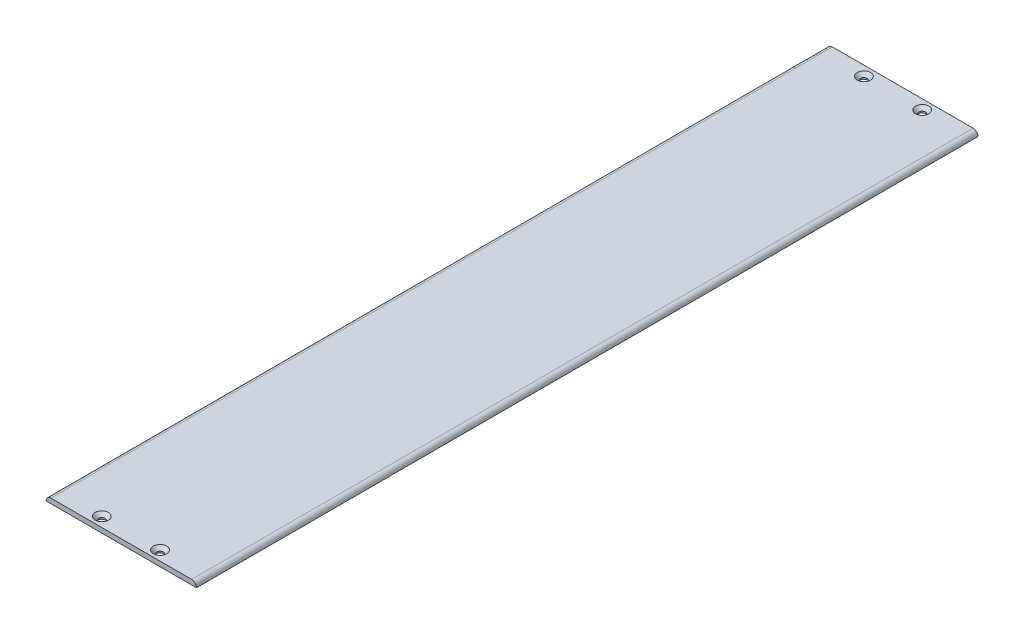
ISO-10303-21;
HEADER;
FILE_DESCRIPTION(('STEP AP214'),'2;1');
FILE_NAME('part.step','',(''),(''),'','','');
FILE_SCHEMA(('AUTOMOTIVE_DESIGN { 1 0 10303 214 1 1 1 1 }'));
ENDSEC;
DATA;
#1=APPLICATION_CONTEXT('core data for automotive mechanical design processes');
#2=APPLICATION_PROTOCOL_DEFINITION('international standard','automotive_design',2000,#1);
#3=PRODUCT_CONTEXT('',#1,'mechanical');
#4=PRODUCT('Part','Part','',(#3));
#5=PRODUCT_RELATED_PRODUCT_CATEGORY('part','',(#4));
#6=PRODUCT_DEFINITION_FORMATION('','',#4);
#7=PRODUCT_DEFINITION_CONTEXT('part definition',#1,'design');
#8=PRODUCT_DEFINITION('design','',#6,#7);
#9=PRODUCT_DEFINITION_SHAPE('','',#8);
#10=(LENGTH_UNIT() NAMED_UNIT(*) SI_UNIT(.MILLI.,.METRE.));
#11=(NAMED_UNIT(*) PLANE_ANGLE_UNIT() SI_UNIT($,.RADIAN.));
#12=(NAMED_UNIT(*) SI_UNIT($,.STERADIAN.) SOLID_ANGLE_UNIT());
#13=UNCERTAINTY_MEASURE_WITH_UNIT(LENGTH_MEASURE(1.E-05),#10,'distance_accuracy_value','');
#14=(GEOMETRIC_REPRESENTATION_CONTEXT(3) GLOBAL_UNCERTAINTY_ASSIGNED_CONTEXT((#13)) GLOBAL_UNIT_ASSIGNED_CONTEXT((#10,
#11,#12)) REPRESENTATION_CONTEXT('',''));
#15=CARTESIAN_POINT('',(0.,0.,0.));
#16=DIRECTION('',(0.,0.,1.));
#17=DIRECTION('',(1.,0.,0.));
#18=AXIS2_PLACEMENT_3D('',#15,#16,#17);
#19=CARTESIAN_POINT('',(-31.,0.,161.));
#20=DIRECTION('',(0.,1.,0.));
#21=DIRECTION('',(0.,0.,1.));
#22=AXIS2_PLACEMENT_3D('',#19,#20,#21);
#23=PLANE('',#22);
#24=CARTESIAN_POINT('',(-12.,0.,157.));
#25=DIRECTION('',(0.,1.,0.));
#26=DIRECTION('',(0.,0.,1.));
#27=AXIS2_PLACEMENT_3D('',#24,#25,#26);
#28=CIRCLE('',#27,1.35);
#29=CARTESIAN_POINT('',(-12.,0.,158.35));
#30=VERTEX_POINT('',#29);
#31=EDGE_CURVE('E141',#30,#30,#28,.T.);
#32=ORIENTED_EDGE('',*,*,#31,.T.);
#33=EDGE_LOOP('',(#32));
#34=FACE_BOUND('',#33,.T.);
#35=CARTESIAN_POINT('',(12.,0.,157.));
#36=DIRECTION('',(0.,1.,0.));
#37=DIRECTION('',(0.,0.,1.));
#38=AXIS2_PLACEMENT_3D('',#35,#36,#37);
#39=CIRCLE('',#38,1.35);
#40=CARTESIAN_POINT('',(12.,0.,158.35));
#41=VERTEX_POINT('',#40);
#42=EDGE_CURVE('E132',#41,#41,#39,.T.);
#43=ORIENTED_EDGE('',*,*,#42,.T.);
#44=EDGE_LOOP('',(#43));
#45=FACE_BOUND('',#44,.T.);
#46=CARTESIAN_POINT('',(12.,0.,-157.));
#47=DIRECTION('',(0.,1.,0.));
#48=DIRECTION('',(0.,0.,1.));
#49=AXIS2_PLACEMENT_3D('',#46,#47,#48);
#50=CIRCLE('',#49,1.35);
#51=CARTESIAN_POINT('',(12.,0.,-155.65));
#52=VERTEX_POINT('',#51);
#53=EDGE_CURVE('E123',#52,#52,#50,.T.);
#54=ORIENTED_EDGE('',*,*,#53,.T.);
#55=EDGE_LOOP('',(#54));
#56=FACE_BOUND('',#55,.T.);
#57=CARTESIAN_POINT('',(-12.,0.,-157.));
#58=DIRECTION('',(0.,1.,0.));
#59=DIRECTION('',(0.,0.,1.));
#60=AXIS2_PLACEMENT_3D('',#57,#58,#59);
#61=CIRCLE('',#60,1.35);
#62=CARTESIAN_POINT('',(-12.,0.,-155.65));
#63=VERTEX_POINT('',#62);
#64=EDGE_CURVE('E109',#63,#63,#61,.T.);
#65=ORIENTED_EDGE('',*,*,#64,.T.);
#66=EDGE_LOOP('',(#65));
#67=FACE_BOUND('',#66,.T.);
#68=DIRECTION('',(1.,0.,0.));
#69=VECTOR('',#68,1.);
#70=CARTESIAN_POINT('',(-31.,0.,-161.));
#71=LINE('',#70,#69);
#72=CARTESIAN_POINT('',(-31.,0.,-161.));
#73=VERTEX_POINT('',#72);
#74=CARTESIAN_POINT('',(31.,0.,-161.));
#75=VERTEX_POINT('',#74);
#76=EDGE_CURVE('E106',#73,#75,#71,.T.);
#77=ORIENTED_EDGE('',*,*,#76,.T.);
#78=DIRECTION('',(0.,0.,-1.));
#79=VECTOR('',#78,1.);
#80=CARTESIAN_POINT('',(31.,0.,161.));
#81=LINE('',#80,#79);
#82=CARTESIAN_POINT('',(31.,0.,161.));
#83=VERTEX_POINT('',#82);
#84=EDGE_CURVE('E89',#83,#75,#81,.T.);
#85=ORIENTED_EDGE('',*,*,#84,.F.);
#86=DIRECTION('',(1.,0.,0.));
#87=VECTOR('',#86,1.);
#88=CARTESIAN_POINT('',(-31.,0.,161.));
#89=LINE('',#88,#87);
#90=CARTESIAN_POINT('',(-31.,0.,161.));
#91=VERTEX_POINT('',#90);
#92=EDGE_CURVE('E78',#91,#83,#89,.T.);
#93=ORIENTED_EDGE('',*,*,#92,.F.);
#94=DIRECTION('',(0.,0.,-1.));
#95=VECTOR('',#94,1.);
#96=CARTESIAN_POINT('',(-31.,0.,161.));
#97=LINE('',#96,#95);
#98=EDGE_CURVE('E87',#91,#73,#97,.T.);
#99=ORIENTED_EDGE('',*,*,#98,.T.);
#100=EDGE_LOOP('',(#77,#85,#93,#99));
#101=FACE_BOUND('',#100,.T.);
#102=ADVANCED_FACE('F38',(#34,#45,#56,#67,#101),#23,.F.);
#103=CARTESIAN_POINT('',(-31.,2.,161.));
#104=DIRECTION('',(0.,-1.,0.));
#105=DIRECTION('',(0.,0.,-1.));
#106=AXIS2_PLACEMENT_3D('',#103,#104,#105);
#107=PLANE('',#106);
#108=CARTESIAN_POINT('',(-12.,2.,157.));
#109=DIRECTION('',(0.,1.,0.));
#110=DIRECTION('',(0.,0.,1.));
#111=AXIS2_PLACEMENT_3D('',#108,#109,#110);
#112=CIRCLE('',#111,2.75);
#113=CARTESIAN_POINT('',(-12.,2.,159.75));
#114=VERTEX_POINT('',#113);
#115=EDGE_CURVE('E147',#114,#114,#112,.T.);
#116=ORIENTED_EDGE('',*,*,#115,.F.);
#117=EDGE_LOOP('',(#116));
#118=FACE_BOUND('',#117,.T.);
#119=CARTESIAN_POINT('',(12.,2.,157.));
#120=DIRECTION('',(0.,1.,0.));
#121=DIRECTION('',(0.,0.,1.));
#122=AXIS2_PLACEMENT_3D('',#119,#120,#121);
#123=CIRCLE('',#122,2.75);
#124=CARTESIAN_POINT('',(12.,2.,159.75));
#125=VERTEX_POINT('',#124);
#126=EDGE_CURVE('E138',#125,#125,#123,.T.);
#127=ORIENTED_EDGE('',*,*,#126,.F.);
#128=EDGE_LOOP('',(#127));
#129=FACE_BOUND('',#128,.T.);
#130=CARTESIAN_POINT('',(12.,2.,-157.));
#131=DIRECTION('',(0.,1.,0.));
#132=DIRECTION('',(0.,0.,1.));
#133=AXIS2_PLACEMENT_3D('',#130,#131,#132);
#134=CIRCLE('',#133,2.75);
#135=CARTESIAN_POINT('',(12.,2.,-154.25));
#136=VERTEX_POINT('',#135);
#137=EDGE_CURVE('E129',#136,#136,#134,.T.);
#138=ORIENTED_EDGE('',*,*,#137,.F.);
#139=EDGE_LOOP('',(#138));
#140=FACE_BOUND('',#139,.T.);
#141=CARTESIAN_POINT('',(-12.,2.,-157.));
#142=DIRECTION('',(0.,1.,0.));
#143=DIRECTION('',(0.,0.,1.));
#144=AXIS2_PLACEMENT_3D('',#141,#142,#143);
#145=CIRCLE('',#144,2.75);
#146=CARTESIAN_POINT('',(-12.,2.,-154.25));
#147=VERTEX_POINT('',#146);
#148=EDGE_CURVE('E120',#147,#147,#145,.T.);
#149=ORIENTED_EDGE('',*,*,#148,.F.);
#150=EDGE_LOOP('',(#149));
#151=FACE_BOUND('',#150,.T.);
#152=DIRECTION('',(-1.,0.,0.));
#153=VECTOR('',#152,1.);
#154=CARTESIAN_POINT('',(-31.,2.,161.));
#155=LINE('',#154,#153);
#156=CARTESIAN_POINT('',(29.,2.,161.));
#157=VERTEX_POINT('',#156);
#158=CARTESIAN_POINT('',(-29.,2.,161.));
#159=VERTEX_POINT('',#158);
#160=EDGE_CURVE('E80',#157,#159,#155,.T.);
#161=ORIENTED_EDGE('',*,*,#160,.F.);
#162=DIRECTION('',(0.,0.,-1.));
#163=VECTOR('',#162,1.);
#164=CARTESIAN_POINT('',(29.,2.,161.));
#165=LINE('',#164,#163);
#166=CARTESIAN_POINT('',(29.,2.,-161.));
#167=VERTEX_POINT('',#166);
#168=EDGE_CURVE('E95',#157,#167,#165,.T.);
#169=ORIENTED_EDGE('',*,*,#168,.T.);
#170=DIRECTION('',(-1.,0.,0.));
#171=VECTOR('',#170,1.);
#172=CARTESIAN_POINT('',(-31.,2.,-161.));
#173=LINE('',#172,#171);
#174=CARTESIAN_POINT('',(-29.,2.,-161.));
#175=VERTEX_POINT('',#174);
#176=EDGE_CURVE('E90',#167,#175,#173,.T.);
#177=ORIENTED_EDGE('',*,*,#176,.T.);
#178=DIRECTION('',(0.,0.,-1.));
#179=VECTOR('',#178,1.);
#180=CARTESIAN_POINT('',(-29.,2.,161.));
#181=LINE('',#180,#179);
#182=EDGE_CURVE('E53',#175,#159,#181,.F.);
#183=ORIENTED_EDGE('',*,*,#182,.T.);
#184=EDGE_LOOP('',(#161,#169,#177,#183));
#185=FACE_BOUND('',#184,.T.);
#186=ADVANCED_FACE('F112',(#118,#129,#140,#151,#185),#107,.F.);
#187=CARTESIAN_POINT('',(-31.,0.,161.));
#188=DIRECTION('',(0.,0.,1.));
#189=DIRECTION('',(1.,0.,0.));
#190=AXIS2_PLACEMENT_3D('',#187,#188,#189);
#191=PLANE('',#190);
#192=ORIENTED_EDGE('',*,*,#92,.T.);
#193=CARTESIAN_POINT('',(29.,0.,161.));
#194=DIRECTION('',(0.,0.,1.));
#195=DIRECTION('',(1.,0.,0.));
#196=AXIS2_PLACEMENT_3D('',#193,#194,#195);
#197=CIRCLE('',#196,2.);
#198=EDGE_CURVE('E11',#83,#157,#197,.T.);
#199=ORIENTED_EDGE('',*,*,#198,.T.);
#200=ORIENTED_EDGE('',*,*,#160,.T.);
#201=CARTESIAN_POINT('',(-29.,0.,161.));
#202=DIRECTION('',(0.,0.,1.));
#203=DIRECTION('',(1.,0.,0.));
#204=AXIS2_PLACEMENT_3D('',#201,#202,#203);
#205=CIRCLE('',#204,2.);
#206=EDGE_CURVE('E46',#159,#91,#205,.T.);
#207=ORIENTED_EDGE('',*,*,#206,.T.);
#208=EDGE_LOOP('',(#192,#199,#200,#207));
#209=FACE_BOUND('',#208,.T.);
#210=ADVANCED_FACE('F77',(#209),#191,.T.);
#211=CARTESIAN_POINT('',(-31.,0.,-161.));
#212=DIRECTION('',(0.,0.,1.));
#213=DIRECTION('',(1.,0.,0.));
#214=AXIS2_PLACEMENT_3D('',#211,#212,#213);
#215=PLANE('',#214);
#216=ORIENTED_EDGE('',*,*,#176,.F.);
#217=CARTESIAN_POINT('',(29.,0.,-161.));
#218=DIRECTION('',(0.,0.,1.));
#219=DIRECTION('',(1.,0.,0.));
#220=AXIS2_PLACEMENT_3D('',#217,#218,#219);
#221=CIRCLE('',#220,2.);
#222=EDGE_CURVE('E83',#167,#75,#221,.F.);
#223=ORIENTED_EDGE('',*,*,#222,.T.);
#224=ORIENTED_EDGE('',*,*,#76,.F.);
#225=CARTESIAN_POINT('',(-29.,0.,-161.));
#226=DIRECTION('',(0.,0.,1.));
#227=DIRECTION('',(1.,0.,0.));
#228=AXIS2_PLACEMENT_3D('',#225,#226,#227);
#229=CIRCLE('',#228,2.);
#230=EDGE_CURVE('E92',#73,#175,#229,.F.);
#231=ORIENTED_EDGE('',*,*,#230,.T.);
#232=EDGE_LOOP('',(#216,#223,#224,#231));
#233=FACE_BOUND('',#232,.T.);
#234=ADVANCED_FACE('F105',(#233),#215,.F.);
#235=CARTESIAN_POINT('',(29.,0.,161.));
#236=DIRECTION('',(0.,0.,-1.));
#237=DIRECTION('',(-1.,0.,0.));
#238=AXIS2_PLACEMENT_3D('',#235,#236,#237);
#239=CYLINDRICAL_SURFACE('',#238,2.);
#240=ORIENTED_EDGE('',*,*,#198,.F.);
#241=ORIENTED_EDGE('',*,*,#84,.T.);
#242=ORIENTED_EDGE('',*,*,#222,.F.);
#243=ORIENTED_EDGE('',*,*,#168,.F.);
#244=EDGE_LOOP('',(#240,#241,#242,#243));
#245=FACE_BOUND('',#244,.T.);
#246=ADVANCED_FACE('F111',(#245),#239,.T.);
#247=CARTESIAN_POINT('',(-29.,0.,161.));
#248=DIRECTION('',(0.,0.,-1.));
#249=DIRECTION('',(-1.,0.,0.));
#250=AXIS2_PLACEMENT_3D('',#247,#248,#249);
#251=CYLINDRICAL_SURFACE('',#250,2.);
#252=ORIENTED_EDGE('',*,*,#206,.F.);
#253=ORIENTED_EDGE('',*,*,#182,.F.);
#254=ORIENTED_EDGE('',*,*,#230,.F.);
#255=ORIENTED_EDGE('',*,*,#98,.F.);
#256=EDGE_LOOP('',(#252,#253,#254,#255));
#257=FACE_BOUND('',#256,.T.);
#258=ADVANCED_FACE('F40',(#257),#251,.T.);
#259=CARTESIAN_POINT('',(-12.,2.,-157.));
#260=DIRECTION('',(0.,1.,0.));
#261=DIRECTION('',(0.,0.,1.));
#262=AXIS2_PLACEMENT_3D('',#259,#260,#261);
#263=CYLINDRICAL_SURFACE('',#262,1.34999999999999);
#264=ORIENTED_EDGE('',*,*,#64,.F.);
#265=EDGE_LOOP('',(#264));
#266=FACE_BOUND('',#265,.T.);
#267=CARTESIAN_POINT('',(-12.,0.599999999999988,-157.));
#268=DIRECTION('',(0.,1.,0.));
#269=DIRECTION('',(0.,0.,1.));
#270=AXIS2_PLACEMENT_3D('',#267,#268,#269);
#271=CIRCLE('',#270,1.34999999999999);
#272=CARTESIAN_POINT('',(-12.,0.599999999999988,-155.65));
#273=VERTEX_POINT('',#272);
#274=EDGE_CURVE('E117',#273,#273,#271,.T.);
#275=ORIENTED_EDGE('',*,*,#274,.T.);
#276=EDGE_LOOP('',(#275));
#277=FACE_BOUND('',#276,.T.);
#278=ADVANCED_FACE('F165',(#266,#277),#263,.F.);
#279=CARTESIAN_POINT('',(-12.,2.,-157.));
#280=DIRECTION('',(0.,1.,0.));
#281=DIRECTION('',(0.,0.,1.));
#282=AXIS2_PLACEMENT_3D('',#279,#280,#281);
#283=CONICAL_SURFACE('',#282,2.75,0.785398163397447);
#284=ORIENTED_EDGE('',*,*,#274,.F.);
#285=EDGE_LOOP('',(#284));
#286=FACE_BOUND('',#285,.T.);
#287=ORIENTED_EDGE('',*,*,#148,.T.);
#288=EDGE_LOOP('',(#287));
#289=FACE_BOUND('',#288,.T.);
#290=ADVANCED_FACE('F162',(#286,#289),#283,.F.);
#291=CARTESIAN_POINT('',(12.,2.,-157.));
#292=DIRECTION('',(0.,1.,0.));
#293=DIRECTION('',(0.,0.,1.));
#294=AXIS2_PLACEMENT_3D('',#291,#292,#293);
#295=CYLINDRICAL_SURFACE('',#294,1.34999999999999);
#296=ORIENTED_EDGE('',*,*,#53,.F.);
#297=EDGE_LOOP('',(#296));
#298=FACE_BOUND('',#297,.T.);
#299=CARTESIAN_POINT('',(12.,0.599999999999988,-157.));
#300=DIRECTION('',(0.,1.,0.));
#301=DIRECTION('',(0.,0.,1.));
#302=AXIS2_PLACEMENT_3D('',#299,#300,#301);
#303=CIRCLE('',#302,1.34999999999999);
#304=CARTESIAN_POINT('',(12.,0.599999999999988,-155.65));
#305=VERTEX_POINT('',#304);
#306=EDGE_CURVE('E126',#305,#305,#303,.T.);
#307=ORIENTED_EDGE('',*,*,#306,.T.);
#308=EDGE_LOOP('',(#307));
#309=FACE_BOUND('',#308,.T.);
#310=ADVANCED_FACE('F164',(#298,#309),#295,.F.);
#311=CARTESIAN_POINT('',(12.,2.,-157.));
#312=DIRECTION('',(0.,1.,0.));
#313=DIRECTION('',(0.,0.,1.));
#314=AXIS2_PLACEMENT_3D('',#311,#312,#313);
#315=CONICAL_SURFACE('',#314,2.75,0.785398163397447);
#316=ORIENTED_EDGE('',*,*,#306,.F.);
#317=EDGE_LOOP('',(#316));
#318=FACE_BOUND('',#317,.T.);
#319=ORIENTED_EDGE('',*,*,#137,.T.);
#320=EDGE_LOOP('',(#319));
#321=FACE_BOUND('',#320,.T.);
#322=ADVANCED_FACE('F172',(#318,#321),#315,.F.);
#323=CARTESIAN_POINT('',(12.,2.,157.));
#324=DIRECTION('',(0.,1.,0.));
#325=DIRECTION('',(0.,0.,1.));
#326=AXIS2_PLACEMENT_3D('',#323,#324,#325);
#327=CYLINDRICAL_SURFACE('',#326,1.34999999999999);
#328=ORIENTED_EDGE('',*,*,#42,.F.);
#329=EDGE_LOOP('',(#328));
#330=FACE_BOUND('',#329,.T.);
#331=CARTESIAN_POINT('',(12.,0.599999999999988,157.));
#332=DIRECTION('',(0.,1.,0.));
#333=DIRECTION('',(0.,0.,1.));
#334=AXIS2_PLACEMENT_3D('',#331,#332,#333);
#335=CIRCLE('',#334,1.34999999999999);
#336=CARTESIAN_POINT('',(12.,0.599999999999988,158.35));
#337=VERTEX_POINT('',#336);
#338=EDGE_CURVE('E135',#337,#337,#335,.T.);
#339=ORIENTED_EDGE('',*,*,#338,.T.);
#340=EDGE_LOOP('',(#339));
#341=FACE_BOUND('',#340,.T.);
#342=ADVANCED_FACE('F229',(#330,#341),#327,.F.);
#343=CARTESIAN_POINT('',(12.,2.,157.));
#344=DIRECTION('',(0.,1.,0.));
#345=DIRECTION('',(0.,0.,1.));
#346=AXIS2_PLACEMENT_3D('',#343,#344,#345);
#347=CONICAL_SURFACE('',#346,2.75,0.785398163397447);
#348=ORIENTED_EDGE('',*,*,#338,.F.);
#349=EDGE_LOOP('',(#348));
#350=FACE_BOUND('',#349,.T.);
#351=ORIENTED_EDGE('',*,*,#126,.T.);
#352=EDGE_LOOP('',(#351));
#353=FACE_BOUND('',#352,.T.);
#354=ADVANCED_FACE('F239',(#350,#353),#347,.F.);
#355=CARTESIAN_POINT('',(-12.,2.,157.));
#356=DIRECTION('',(0.,1.,0.));
#357=DIRECTION('',(0.,0.,1.));
#358=AXIS2_PLACEMENT_3D('',#355,#356,#357);
#359=CYLINDRICAL_SURFACE('',#358,1.34999999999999);
#360=ORIENTED_EDGE('',*,*,#31,.F.);
#361=EDGE_LOOP('',(#360));
#362=FACE_BOUND('',#361,.T.);
#363=CARTESIAN_POINT('',(-12.,0.599999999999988,157.));
#364=DIRECTION('',(0.,1.,0.));
#365=DIRECTION('',(0.,0.,1.));
#366=AXIS2_PLACEMENT_3D('',#363,#364,#365);
#367=CIRCLE('',#366,1.34999999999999);
#368=CARTESIAN_POINT('',(-12.,0.599999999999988,158.35));
#369=VERTEX_POINT('',#368);
#370=EDGE_CURVE('E144',#369,#369,#367,.T.);
#371=ORIENTED_EDGE('',*,*,#370,.T.);
#372=EDGE_LOOP('',(#371));
#373=FACE_BOUND('',#372,.T.);
#374=ADVANCED_FACE('F249',(#362,#373),#359,.F.);
#375=CARTESIAN_POINT('',(-12.,2.,157.));
#376=DIRECTION('',(0.,1.,0.));
#377=DIRECTION('',(0.,0.,1.));
#378=AXIS2_PLACEMENT_3D('',#375,#376,#377);
#379=CONICAL_SURFACE('',#378,2.75,0.785398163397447);
#380=ORIENTED_EDGE('',*,*,#370,.F.);
#381=EDGE_LOOP('',(#380));
#382=FACE_BOUND('',#381,.T.);
#383=ORIENTED_EDGE('',*,*,#115,.T.);
#384=EDGE_LOOP('',(#383));
#385=FACE_BOUND('',#384,.T.);
#386=ADVANCED_FACE('F151',(#382,#385),#379,.F.);
#387=CLOSED_SHELL('',(#102,#186,#210,#234,#246,#258,#278,#290,#310,#322,#342,#354,#374,#386));
#388=MANIFOLD_SOLID_BREP('B2',#387);
#389=ADVANCED_BREP_SHAPE_REPRESENTATION('',(#18,#388),#14);
#390=SHAPE_DEFINITION_REPRESENTATION(#9,#389);
ENDSEC;
END-ISO-10303-21;
